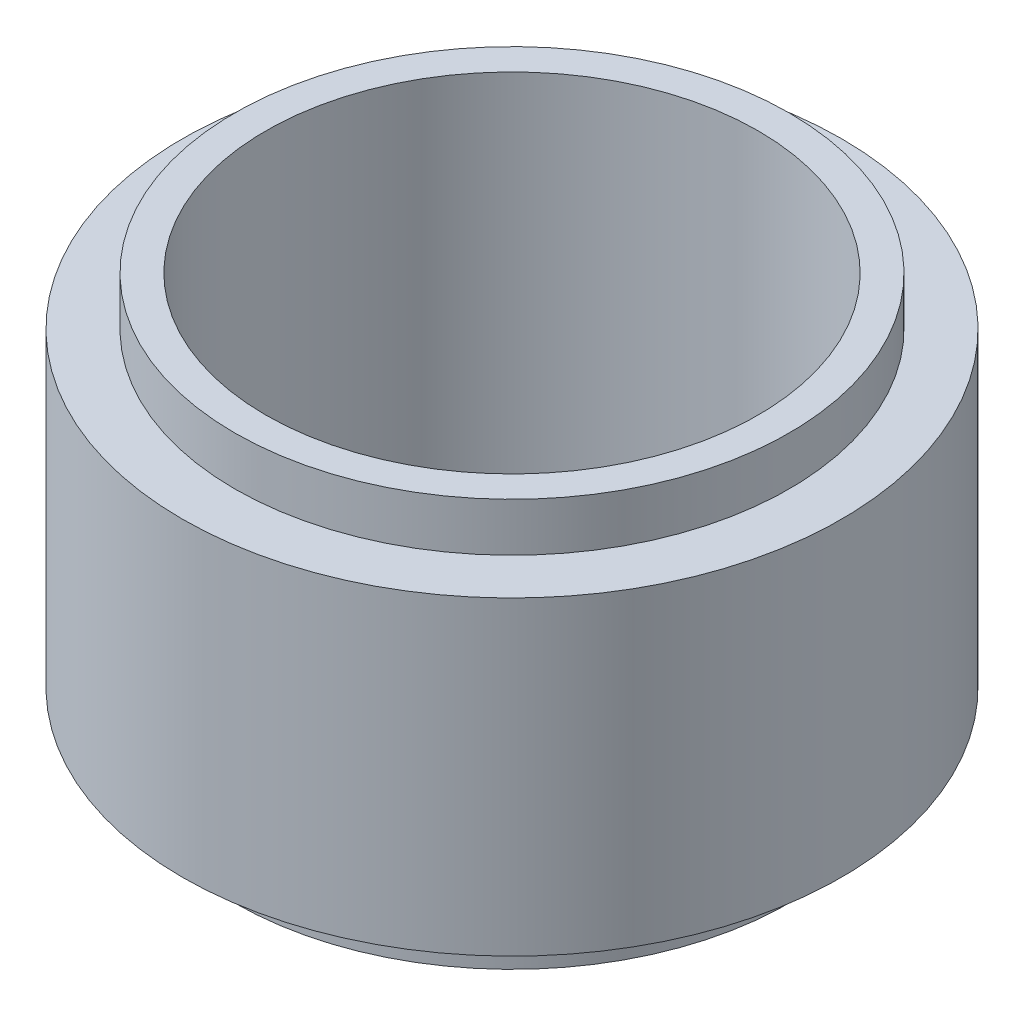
ISO-10303-21;
HEADER;
FILE_DESCRIPTION(('STEP AP214'),'2;1');
FILE_NAME('part.step','',(''),(''),'','','');
FILE_SCHEMA(('AUTOMOTIVE_DESIGN { 1 0 10303 214 1 1 1 1 }'));
ENDSEC;
DATA;
#1=APPLICATION_CONTEXT('core data for automotive mechanical design processes');
#2=APPLICATION_PROTOCOL_DEFINITION('international standard','automotive_design',2000,#1);
#3=PRODUCT_CONTEXT('',#1,'mechanical');
#4=PRODUCT('Part','Part','',(#3));
#5=PRODUCT_RELATED_PRODUCT_CATEGORY('part','',(#4));
#6=PRODUCT_DEFINITION_FORMATION('','',#4);
#7=PRODUCT_DEFINITION_CONTEXT('part definition',#1,'design');
#8=PRODUCT_DEFINITION('design','',#6,#7);
#9=PRODUCT_DEFINITION_SHAPE('','',#8);
#10=(LENGTH_UNIT() NAMED_UNIT(*) SI_UNIT(.MILLI.,.METRE.));
#11=(NAMED_UNIT(*) PLANE_ANGLE_UNIT() SI_UNIT($,.RADIAN.));
#12=(NAMED_UNIT(*) SI_UNIT($,.STERADIAN.) SOLID_ANGLE_UNIT());
#13=UNCERTAINTY_MEASURE_WITH_UNIT(LENGTH_MEASURE(1.E-05),#10,'distance_accuracy_value','');
#14=(GEOMETRIC_REPRESENTATION_CONTEXT(3) GLOBAL_UNCERTAINTY_ASSIGNED_CONTEXT((#13)) GLOBAL_UNIT_ASSIGNED_CONTEXT((#10,
#11,#12)) REPRESENTATION_CONTEXT('',''));
#15=CARTESIAN_POINT('',(0.,0.,0.));
#16=DIRECTION('',(0.,0.,1.));
#17=DIRECTION('',(1.,0.,0.));
#18=AXIS2_PLACEMENT_3D('',#15,#16,#17);
#19=CARTESIAN_POINT('',(8.5,-4.,0.));
#20=DIRECTION('',(0.,1.,0.));
#21=DIRECTION('',(0.,0.,1.));
#22=AXIS2_PLACEMENT_3D('',#19,#20,#21);
#23=PLANE('',#22);
#24=CARTESIAN_POINT('',(0.,-4.,0.));
#25=DIRECTION('',(0.,-1.,0.));
#26=DIRECTION('',(0.,0.,-1.));
#27=AXIS2_PLACEMENT_3D('',#24,#25,#26);
#28=CIRCLE('',#27,7.15);
#29=CARTESIAN_POINT('',(0.,-4.,-7.15));
#30=VERTEX_POINT('',#29);
#31=EDGE_CURVE('E70',#30,#30,#28,.T.);
#32=ORIENTED_EDGE('',*,*,#31,.F.);
#33=EDGE_LOOP('',(#32));
#34=FACE_BOUND('',#33,.T.);
#35=CARTESIAN_POINT('',(0.,-4.,0.));
#36=DIRECTION('',(0.,-1.,0.));
#37=DIRECTION('',(0.,0.,-1.));
#38=AXIS2_PLACEMENT_3D('',#35,#36,#37);
#39=CIRCLE('',#38,8.5);
#40=CARTESIAN_POINT('',(0.,-4.,-8.5));
#41=VERTEX_POINT('',#40);
#42=EDGE_CURVE('E10',#41,#41,#39,.T.);
#43=ORIENTED_EDGE('',*,*,#42,.T.);
#44=EDGE_LOOP('',(#43));
#45=FACE_BOUND('',#44,.T.);
#46=ADVANCED_FACE('F39',(#34,#45),#23,.F.);
#47=CARTESIAN_POINT('',(0.,0.,0.));
#48=DIRECTION('',(0.,-1.,0.));
#49=DIRECTION('',(0.,0.,-1.));
#50=AXIS2_PLACEMENT_3D('',#47,#48,#49);
#51=CYLINDRICAL_SURFACE('',#50,8.5);
#52=ORIENTED_EDGE('',*,*,#42,.F.);
#53=EDGE_LOOP('',(#52));
#54=FACE_BOUND('',#53,.T.);
#55=CARTESIAN_POINT('',(0.,4.,0.));
#56=DIRECTION('',(0.,-1.,0.));
#57=DIRECTION('',(0.,0.,-1.));
#58=AXIS2_PLACEMENT_3D('',#55,#56,#57);
#59=CIRCLE('',#58,8.5);
#60=CARTESIAN_POINT('',(0.,4.,-8.5));
#61=VERTEX_POINT('',#60);
#62=EDGE_CURVE('E44',#61,#61,#59,.T.);
#63=ORIENTED_EDGE('',*,*,#62,.T.);
#64=EDGE_LOOP('',(#63));
#65=FACE_BOUND('',#64,.T.);
#66=ADVANCED_FACE('F74',(#54,#65),#51,.T.);
#67=CARTESIAN_POINT('',(8.5,4.,0.));
#68=DIRECTION('',(0.,1.,0.));
#69=DIRECTION('',(0.,0.,1.));
#70=AXIS2_PLACEMENT_3D('',#67,#68,#69);
#71=PLANE('',#70);
#72=CARTESIAN_POINT('',(0.,4.,0.));
#73=DIRECTION('',(0.,-1.,0.));
#74=DIRECTION('',(0.,0.,-1.));
#75=AXIS2_PLACEMENT_3D('',#72,#73,#74);
#76=CIRCLE('',#75,7.15);
#77=CARTESIAN_POINT('',(0.,4.,-7.15));
#78=VERTEX_POINT('',#77);
#79=EDGE_CURVE('E47',#78,#78,#76,.T.);
#80=ORIENTED_EDGE('',*,*,#79,.T.);
#81=EDGE_LOOP('',(#80));
#82=FACE_BOUND('',#81,.T.);
#83=ORIENTED_EDGE('',*,*,#62,.F.);
#84=EDGE_LOOP('',(#83));
#85=FACE_BOUND('',#84,.T.);
#86=ADVANCED_FACE('F80',(#82,#85),#71,.T.);
#87=CARTESIAN_POINT('',(0.,0.,0.));
#88=DIRECTION('',(0.,-1.,0.));
#89=DIRECTION('',(0.,0.,-1.));
#90=AXIS2_PLACEMENT_3D('',#87,#88,#89);
#91=CYLINDRICAL_SURFACE('',#90,7.15);
#92=ORIENTED_EDGE('',*,*,#79,.F.);
#93=EDGE_LOOP('',(#92));
#94=FACE_BOUND('',#93,.T.);
#95=CARTESIAN_POINT('',(0.,5.25,0.));
#96=DIRECTION('',(0.,-1.,0.));
#97=DIRECTION('',(0.,0.,-1.));
#98=AXIS2_PLACEMENT_3D('',#95,#96,#97);
#99=CIRCLE('',#98,7.15);
#100=CARTESIAN_POINT('',(0.,5.25,-7.15));
#101=VERTEX_POINT('',#100);
#102=EDGE_CURVE('E52',#101,#101,#99,.T.);
#103=ORIENTED_EDGE('',*,*,#102,.T.);
#104=EDGE_LOOP('',(#103));
#105=FACE_BOUND('',#104,.T.);
#106=ADVANCED_FACE('F81',(#94,#105),#91,.T.);
#107=CARTESIAN_POINT('',(7.15,5.25,0.));
#108=DIRECTION('',(0.,1.,0.));
#109=DIRECTION('',(0.,0.,1.));
#110=AXIS2_PLACEMENT_3D('',#107,#108,#109);
#111=PLANE('',#110);
#112=CARTESIAN_POINT('',(0.,5.25,0.));
#113=DIRECTION('',(0.,-1.,0.));
#114=DIRECTION('',(0.,0.,-1.));
#115=AXIS2_PLACEMENT_3D('',#112,#113,#114);
#116=CIRCLE('',#115,6.35);
#117=CARTESIAN_POINT('',(0.,5.25,-6.35));
#118=VERTEX_POINT('',#117);
#119=EDGE_CURVE('E59',#118,#118,#116,.T.);
#120=ORIENTED_EDGE('',*,*,#119,.T.);
#121=EDGE_LOOP('',(#120));
#122=FACE_BOUND('',#121,.T.);
#123=ORIENTED_EDGE('',*,*,#102,.F.);
#124=EDGE_LOOP('',(#123));
#125=FACE_BOUND('',#124,.T.);
#126=ADVANCED_FACE('F89',(#122,#125),#111,.T.);
#127=CARTESIAN_POINT('',(0.,0.,0.));
#128=DIRECTION('',(0.,-1.,0.));
#129=DIRECTION('',(0.,0.,-1.));
#130=AXIS2_PLACEMENT_3D('',#127,#128,#129);
#131=CYLINDRICAL_SURFACE('',#130,6.35);
#132=CARTESIAN_POINT('',(0.,-5.25,0.));
#133=DIRECTION('',(0.,-1.,0.));
#134=DIRECTION('',(0.,0.,-1.));
#135=AXIS2_PLACEMENT_3D('',#132,#133,#134);
#136=CIRCLE('',#135,6.35);
#137=CARTESIAN_POINT('',(0.,-5.25,-6.35));
#138=VERTEX_POINT('',#137);
#139=EDGE_CURVE('E61',#138,#138,#136,.T.);
#140=ORIENTED_EDGE('',*,*,#139,.T.);
#141=EDGE_LOOP('',(#140));
#142=FACE_BOUND('',#141,.T.);
#143=ORIENTED_EDGE('',*,*,#119,.F.);
#144=EDGE_LOOP('',(#143));
#145=FACE_BOUND('',#144,.T.);
#146=ADVANCED_FACE('F94',(#142,#145),#131,.F.);
#147=CARTESIAN_POINT('',(7.15,-5.25,0.));
#148=DIRECTION('',(0.,1.,0.));
#149=DIRECTION('',(0.,0.,1.));
#150=AXIS2_PLACEMENT_3D('',#147,#148,#149);
#151=PLANE('',#150);
#152=ORIENTED_EDGE('',*,*,#139,.F.);
#153=EDGE_LOOP('',(#152));
#154=FACE_BOUND('',#153,.T.);
#155=CARTESIAN_POINT('',(0.,-5.25,0.));
#156=DIRECTION('',(0.,-1.,0.));
#157=DIRECTION('',(0.,0.,-1.));
#158=AXIS2_PLACEMENT_3D('',#155,#156,#157);
#159=CIRCLE('',#158,7.15);
#160=CARTESIAN_POINT('',(0.,-5.25,-7.15));
#161=VERTEX_POINT('',#160);
#162=EDGE_CURVE('E63',#161,#161,#159,.T.);
#163=ORIENTED_EDGE('',*,*,#162,.T.);
#164=EDGE_LOOP('',(#163));
#165=FACE_BOUND('',#164,.T.);
#166=ADVANCED_FACE('F98',(#154,#165),#151,.F.);
#167=CARTESIAN_POINT('',(0.,0.,0.));
#168=DIRECTION('',(0.,-1.,0.));
#169=DIRECTION('',(0.,0.,-1.));
#170=AXIS2_PLACEMENT_3D('',#167,#168,#169);
#171=CYLINDRICAL_SURFACE('',#170,7.15);
#172=ORIENTED_EDGE('',*,*,#162,.F.);
#173=EDGE_LOOP('',(#172));
#174=FACE_BOUND('',#173,.T.);
#175=ORIENTED_EDGE('',*,*,#31,.T.);
#176=EDGE_LOOP('',(#175));
#177=FACE_BOUND('',#176,.T.);
#178=ADVANCED_FACE('F72',(#174,#177),#171,.T.);
#179=CLOSED_SHELL('',(#46,#66,#86,#106,#126,#146,#166,#178));
#180=MANIFOLD_SOLID_BREP('B2',#179);
#181=ADVANCED_BREP_SHAPE_REPRESENTATION('',(#18,#180),#14);
#182=SHAPE_DEFINITION_REPRESENTATION(#9,#181);
ENDSEC;
END-ISO-10303-21;
